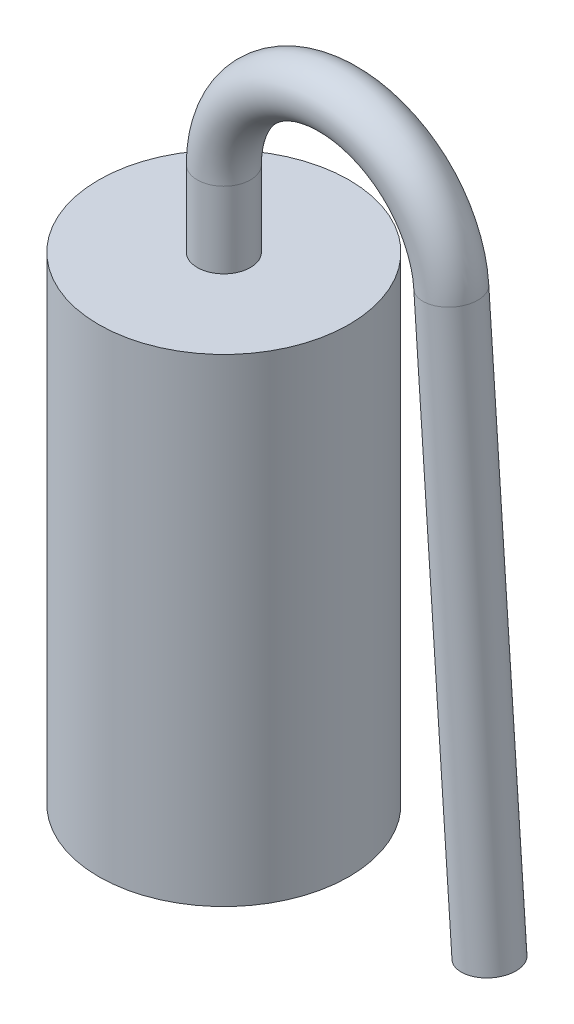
ISO-10303-21;
HEADER;
FILE_DESCRIPTION(('STEP AP214'),'2;1');
FILE_NAME('part.step','',(''),(''),'','','');
FILE_SCHEMA(('AUTOMOTIVE_DESIGN { 1 0 10303 214 1 1 1 1 }'));
ENDSEC;
DATA;
#1=APPLICATION_CONTEXT('core data for automotive mechanical design processes');
#2=APPLICATION_PROTOCOL_DEFINITION('international standard','automotive_design',2000,#1);
#3=PRODUCT_CONTEXT('',#1,'mechanical');
#4=PRODUCT('Part','Part','',(#3));
#5=PRODUCT_RELATED_PRODUCT_CATEGORY('part','',(#4));
#6=PRODUCT_DEFINITION_FORMATION('','',#4);
#7=PRODUCT_DEFINITION_CONTEXT('part definition',#1,'design');
#8=PRODUCT_DEFINITION('design','',#6,#7);
#9=PRODUCT_DEFINITION_SHAPE('','',#8);
#10=(LENGTH_UNIT() NAMED_UNIT(*) SI_UNIT(.MILLI.,.METRE.));
#11=(NAMED_UNIT(*) PLANE_ANGLE_UNIT() SI_UNIT($,.RADIAN.));
#12=(NAMED_UNIT(*) SI_UNIT($,.STERADIAN.) SOLID_ANGLE_UNIT());
#13=UNCERTAINTY_MEASURE_WITH_UNIT(LENGTH_MEASURE(1.E-05),#10,'distance_accuracy_value','');
#14=(GEOMETRIC_REPRESENTATION_CONTEXT(3) GLOBAL_UNCERTAINTY_ASSIGNED_CONTEXT((#13)) GLOBAL_UNIT_ASSIGNED_CONTEXT((#10,
#11,#12)) REPRESENTATION_CONTEXT('',''));
#15=CARTESIAN_POINT('',(0.,0.,0.));
#16=DIRECTION('',(0.,0.,1.));
#17=DIRECTION('',(1.,0.,0.));
#18=AXIS2_PLACEMENT_3D('',#15,#16,#17);
#19=CARTESIAN_POINT('',(1.5,7.3,0.));
#20=DIRECTION('',(0.,0.,-1.));
#21=DIRECTION('',(-1.,0.,0.));
#22=AXIS2_PLACEMENT_3D('',#19,#20,#21);
#23=TOROIDAL_SURFACE('',#22,1.5,0.35);
#24=CARTESIAN_POINT('',(0.,7.3,0.));
#25=DIRECTION('',(0.,1.,0.));
#26=DIRECTION('',(0.,0.,1.));
#27=AXIS2_PLACEMENT_3D('',#24,#25,#26);
#28=CIRCLE('',#27,0.35);
#29=CARTESIAN_POINT('',(-0.35,7.3,0.));
#30=VERTEX_POINT('',#29);
#31=EDGE_CURVE('E9',#30,#30,#28,.T.);
#32=CARTESIAN_POINT('',(2.99654211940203,7.40179236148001,0.));
#33=DIRECTION('',(0.0678615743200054,-0.997694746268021,0.));
#34=DIRECTION('',(0.,0.,1.));
#35=AXIS2_PLACEMENT_3D('',#32,#33,#34);
#36=CIRCLE('',#35,0.35);
#37=CARTESIAN_POINT('',(3.34573528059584,7.42554391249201,0.));
#38=VERTEX_POINT('',#37);
#39=EDGE_CURVE('E29',#38,#38,#36,.T.);
#40=CARTESIAN_POINT('',(1.5,7.3,0.));
#41=DIRECTION('',(0.,0.,-1.));
#42=DIRECTION('',(-1.,0.,0.));
#43=AXIS2_PLACEMENT_3D('',#40,#41,#42);
#44=CIRCLE('',#43,1.85);
#45=EDGE_CURVE('',#30,#38,#44,.T.);
#46=ORIENTED_EDGE('',*,*,#31,.T.);
#47=ORIENTED_EDGE('',*,*,#39,.F.);
#48=ORIENTED_EDGE('',*,*,#45,.T.);
#49=ORIENTED_EDGE('',*,*,#45,.F.);
#50=EDGE_LOOP('',(#46,#48,#47,#49));
#51=FACE_BOUND('',#50,.T.);
#52=ADVANCED_FACE('F14',(#51),#23,.T.);
#53=CARTESIAN_POINT('',(0.,7.3,0.));
#54=DIRECTION('',(0.,-1.,0.));
#55=DIRECTION('',(0.,0.,-1.));
#56=AXIS2_PLACEMENT_3D('',#53,#54,#55);
#57=CYLINDRICAL_SURFACE('',#56,0.35);
#58=CARTESIAN_POINT('',(0.,6.3,0.));
#59=DIRECTION('',(0.,1.,0.));
#60=DIRECTION('',(0.,0.,1.));
#61=AXIS2_PLACEMENT_3D('',#58,#59,#60);
#62=CIRCLE('',#61,0.35);
#63=CARTESIAN_POINT('',(0.,6.3,0.35));
#64=VERTEX_POINT('',#63);
#65=EDGE_CURVE('E22',#64,#64,#62,.T.);
#66=ORIENTED_EDGE('',*,*,#65,.T.);
#67=EDGE_LOOP('',(#66));
#68=FACE_BOUND('',#67,.T.);
#69=ORIENTED_EDGE('',*,*,#31,.F.);
#70=EDGE_LOOP('',(#69));
#71=FACE_BOUND('',#70,.T.);
#72=ADVANCED_FACE('F56',(#68,#71),#57,.T.);
#73=CARTESIAN_POINT('',(2.99654211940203,7.40179236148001,0.));
#74=DIRECTION('',(0.0678615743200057,-0.997694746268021,0.));
#75=DIRECTION('',(0.997694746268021,0.0678615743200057,0.));
#76=AXIS2_PLACEMENT_3D('',#73,#74,#75);
#77=CYLINDRICAL_SURFACE('',#76,0.35);
#78=CARTESIAN_POINT('',(3.5,0.,0.));
#79=DIRECTION('',(0.0678615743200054,-0.997694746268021,0.));
#80=DIRECTION('',(0.,0.,1.));
#81=AXIS2_PLACEMENT_3D('',#78,#79,#80);
#82=CIRCLE('',#81,0.35);
#83=CARTESIAN_POINT('',(3.5,0.,0.35));
#84=VERTEX_POINT('',#83);
#85=EDGE_CURVE('E32',#84,#84,#82,.T.);
#86=ORIENTED_EDGE('',*,*,#85,.F.);
#87=EDGE_LOOP('',(#86));
#88=FACE_BOUND('',#87,.T.);
#89=ORIENTED_EDGE('',*,*,#39,.T.);
#90=EDGE_LOOP('',(#89));
#91=FACE_BOUND('',#90,.T.);
#92=ADVANCED_FACE('F62',(#88,#91),#77,.T.);
#93=CARTESIAN_POINT('',(0.,6.3,0.));
#94=DIRECTION('',(0.,-1.,0.));
#95=DIRECTION('',(0.,0.,-1.));
#96=AXIS2_PLACEMENT_3D('',#93,#94,#95);
#97=CYLINDRICAL_SURFACE('',#96,1.65);
#98=CARTESIAN_POINT('',(0.,0.,0.));
#99=DIRECTION('',(0.,1.,0.));
#100=DIRECTION('',(0.,0.,1.));
#101=AXIS2_PLACEMENT_3D('',#98,#99,#100);
#102=CIRCLE('',#101,1.65);
#103=CARTESIAN_POINT('',(0.,0.,1.65));
#104=VERTEX_POINT('',#103);
#105=EDGE_CURVE('E18',#104,#104,#102,.T.);
#106=ORIENTED_EDGE('',*,*,#105,.T.);
#107=EDGE_LOOP('',(#106));
#108=FACE_BOUND('',#107,.T.);
#109=CARTESIAN_POINT('',(0.,6.3,0.));
#110=DIRECTION('',(0.,1.,0.));
#111=DIRECTION('',(0.,0.,1.));
#112=AXIS2_PLACEMENT_3D('',#109,#110,#111);
#113=CIRCLE('',#112,1.65);
#114=CARTESIAN_POINT('',(0.,6.3,1.65));
#115=VERTEX_POINT('',#114);
#116=EDGE_CURVE('E31',#115,#115,#113,.T.);
#117=ORIENTED_EDGE('',*,*,#116,.F.);
#118=EDGE_LOOP('',(#117));
#119=FACE_BOUND('',#118,.T.);
#120=ADVANCED_FACE('F41',(#108,#119),#97,.T.);
#121=CARTESIAN_POINT('',(0.,6.3,0.));
#122=DIRECTION('',(0.,1.,0.));
#123=DIRECTION('',(0.,0.,1.));
#124=AXIS2_PLACEMENT_3D('',#121,#122,#123);
#125=PLANE('',#124);
#126=ORIENTED_EDGE('',*,*,#65,.F.);
#127=EDGE_LOOP('',(#126));
#128=FACE_BOUND('',#127,.T.);
#129=ORIENTED_EDGE('',*,*,#116,.T.);
#130=EDGE_LOOP('',(#129));
#131=FACE_BOUND('',#130,.T.);
#132=ADVANCED_FACE('F46',(#128,#131),#125,.T.);
#133=CARTESIAN_POINT('',(0.,0.,0.));
#134=DIRECTION('',(0.,1.,0.));
#135=DIRECTION('',(0.,0.,1.));
#136=AXIS2_PLACEMENT_3D('',#133,#134,#135);
#137=PLANE('',#136);
#138=ORIENTED_EDGE('',*,*,#105,.F.);
#139=EDGE_LOOP('',(#138));
#140=FACE_BOUND('',#139,.T.);
#141=ADVANCED_FACE('F44',(#140),#137,.F.);
#142=CARTESIAN_POINT('',(3.5,0.,0.));
#143=DIRECTION('',(0.0678615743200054,-0.997694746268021,0.));
#144=DIRECTION('',(0.,0.,1.));
#145=AXIS2_PLACEMENT_3D('',#142,#143,#144);
#146=PLANE('',#145);
#147=ORIENTED_EDGE('',*,*,#85,.T.);
#148=EDGE_LOOP('',(#147));
#149=FACE_BOUND('',#148,.T.);
#150=ADVANCED_FACE('F16',(#149),#146,.T.);
#151=CLOSED_SHELL('',(#52,#72,#92,#120,#132,#141,#150));
#152=MANIFOLD_SOLID_BREP('B1',#151);
#153=ADVANCED_BREP_SHAPE_REPRESENTATION('',(#18,#152),#14);
#154=SHAPE_DEFINITION_REPRESENTATION(#9,#153);
ENDSEC;
END-ISO-10303-21;
